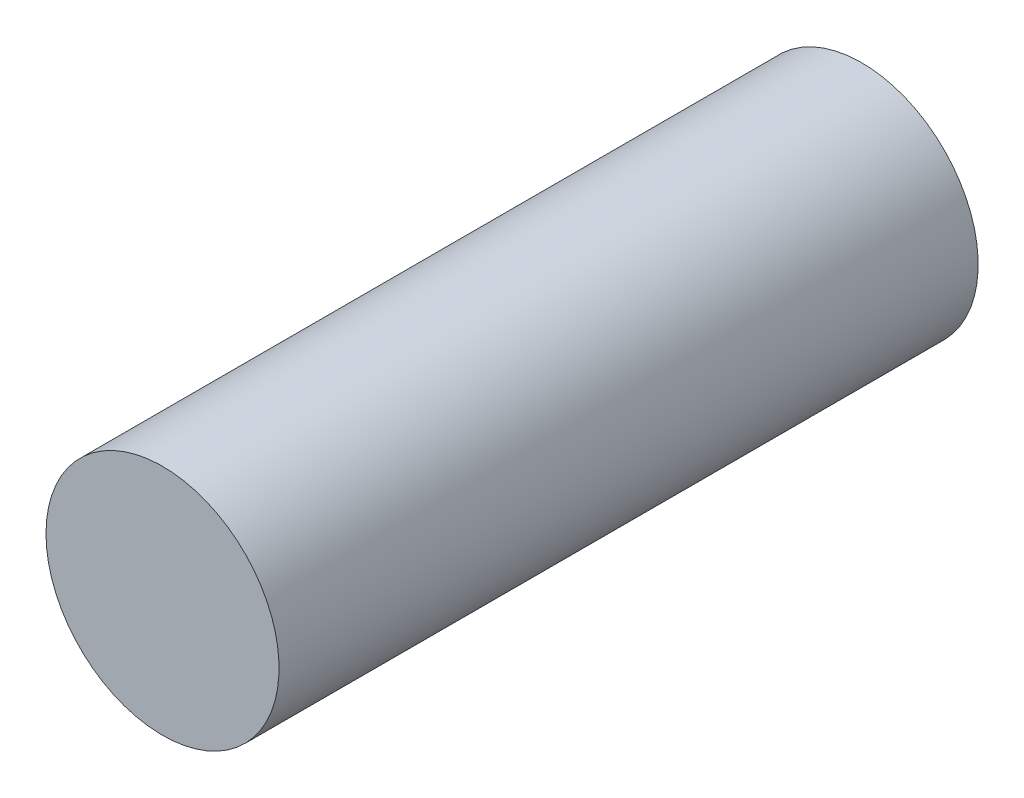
ISO-10303-21;
HEADER;
FILE_DESCRIPTION(('STEP AP214'),'2;1');
FILE_NAME('part.step','',(''),(''),'','','');
FILE_SCHEMA(('AUTOMOTIVE_DESIGN { 1 0 10303 214 1 1 1 1 }'));
ENDSEC;
DATA;
#1=APPLICATION_CONTEXT('core data for automotive mechanical design processes');
#2=APPLICATION_PROTOCOL_DEFINITION('international standard','automotive_design',2000,#1);
#3=PRODUCT_CONTEXT('',#1,'mechanical');
#4=PRODUCT('Part','Part','',(#3));
#5=PRODUCT_RELATED_PRODUCT_CATEGORY('part','',(#4));
#6=PRODUCT_DEFINITION_FORMATION('','',#4);
#7=PRODUCT_DEFINITION_CONTEXT('part definition',#1,'design');
#8=PRODUCT_DEFINITION('design','',#6,#7);
#9=PRODUCT_DEFINITION_SHAPE('','',#8);
#10=(LENGTH_UNIT() NAMED_UNIT(*) SI_UNIT(.MILLI.,.METRE.));
#11=(NAMED_UNIT(*) PLANE_ANGLE_UNIT() SI_UNIT($,.RADIAN.));
#12=(NAMED_UNIT(*) SI_UNIT($,.STERADIAN.) SOLID_ANGLE_UNIT());
#13=UNCERTAINTY_MEASURE_WITH_UNIT(LENGTH_MEASURE(1.E-05),#10,'distance_accuracy_value','');
#14=(GEOMETRIC_REPRESENTATION_CONTEXT(3) GLOBAL_UNCERTAINTY_ASSIGNED_CONTEXT((#13)) GLOBAL_UNIT_ASSIGNED_CONTEXT((#10,
#11,#12)) REPRESENTATION_CONTEXT('',''));
#15=CARTESIAN_POINT('',(0.,0.,0.));
#16=DIRECTION('',(0.,0.,1.));
#17=DIRECTION('',(1.,0.,0.));
#18=AXIS2_PLACEMENT_3D('',#15,#16,#17);
#19=CARTESIAN_POINT('',(0.,0.,50.8));
#20=DIRECTION('',(0.,0.,-1.));
#21=DIRECTION('',(-1.,0.,0.));
#22=AXIS2_PLACEMENT_3D('',#19,#20,#21);
#23=CYLINDRICAL_SURFACE('',#22,12.7);
#24=CARTESIAN_POINT('',(0.,0.,50.8));
#25=DIRECTION('',(0.,0.,1.));
#26=DIRECTION('',(1.,0.,0.));
#27=AXIS2_PLACEMENT_3D('',#24,#25,#26);
#28=CIRCLE('',#27,12.7);
#29=CARTESIAN_POINT('',(-12.7,0.,50.8));
#30=VERTEX_POINT('',#29);
#31=EDGE_CURVE('E10',#30,#30,#28,.T.);
#32=CARTESIAN_POINT('',(0.,0.,-25.4));
#33=DIRECTION('',(0.,0.,1.));
#34=DIRECTION('',(1.,0.,0.));
#35=AXIS2_PLACEMENT_3D('',#32,#33,#34);
#36=CIRCLE('',#35,12.7);
#37=CARTESIAN_POINT('',(-12.7,0.,-25.4));
#38=VERTEX_POINT('',#37);
#39=EDGE_CURVE('E30',#38,#38,#36,.T.);
#40=CARTESIAN_POINT('',(-12.7,0.,50.8));
#41=CARTESIAN_POINT('',(-12.7,0.,50.00625));
#42=CARTESIAN_POINT('',(-12.7,0.,49.2125));
#43=CARTESIAN_POINT('',(-12.7,0.,47.625));
#44=CARTESIAN_POINT('',(-12.7,0.,46.83125));
#45=CARTESIAN_POINT('',(-12.7,0.,45.24375));
#46=CARTESIAN_POINT('',(-12.7,0.,44.45));
#47=CARTESIAN_POINT('',(-12.7,0.,42.8625));
#48=CARTESIAN_POINT('',(-12.7,0.,42.06875));
#49=CARTESIAN_POINT('',(-12.7,0.,40.48125));
#50=CARTESIAN_POINT('',(-12.7,0.,39.6875));
#51=CARTESIAN_POINT('',(-12.7,0.,38.1));
#52=CARTESIAN_POINT('',(-12.7,0.,37.30625));
#53=CARTESIAN_POINT('',(-12.7,0.,35.71875));
#54=CARTESIAN_POINT('',(-12.7,0.,34.925));
#55=CARTESIAN_POINT('',(-12.7,0.,33.3375));
#56=CARTESIAN_POINT('',(-12.7,0.,32.54375));
#57=CARTESIAN_POINT('',(-12.7,0.,30.95625));
#58=CARTESIAN_POINT('',(-12.7,0.,30.1625));
#59=CARTESIAN_POINT('',(-12.7,0.,28.575));
#60=CARTESIAN_POINT('',(-12.7,0.,27.78125));
#61=CARTESIAN_POINT('',(-12.7,0.,26.19375));
#62=CARTESIAN_POINT('',(-12.7,0.,25.4));
#63=CARTESIAN_POINT('',(-12.7,0.,23.8125));
#64=CARTESIAN_POINT('',(-12.7,0.,23.01875));
#65=CARTESIAN_POINT('',(-12.7,0.,21.43125));
#66=CARTESIAN_POINT('',(-12.7,0.,20.6375));
#67=CARTESIAN_POINT('',(-12.7,0.,19.05));
#68=CARTESIAN_POINT('',(-12.7,0.,18.25625));
#69=CARTESIAN_POINT('',(-12.7,0.,16.66875));
#70=CARTESIAN_POINT('',(-12.7,0.,15.875));
#71=CARTESIAN_POINT('',(-12.7,0.,14.2875));
#72=CARTESIAN_POINT('',(-12.7,0.,13.49375));
#73=CARTESIAN_POINT('',(-12.7,0.,11.90625));
#74=CARTESIAN_POINT('',(-12.7,0.,11.1125));
#75=CARTESIAN_POINT('',(-12.7,0.,9.52499999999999));
#76=CARTESIAN_POINT('',(-12.7,0.,8.73124999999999));
#77=CARTESIAN_POINT('',(-12.7,0.,7.14374999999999));
#78=CARTESIAN_POINT('',(-12.7,0.,6.34999999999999));
#79=CARTESIAN_POINT('',(-12.7,0.,4.76249999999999));
#80=CARTESIAN_POINT('',(-12.7,0.,3.96874999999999));
#81=CARTESIAN_POINT('',(-12.7,0.,2.38124999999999));
#82=CARTESIAN_POINT('',(-12.7,0.,1.58749999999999));
#83=CARTESIAN_POINT('',(-12.7,0.,0.));
#84=CARTESIAN_POINT('',(-12.7,0.,-0.793750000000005));
#85=CARTESIAN_POINT('',(-12.7,0.,-2.38125000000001));
#86=CARTESIAN_POINT('',(-12.7,0.,-3.17500000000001));
#87=CARTESIAN_POINT('',(-12.7,0.,-4.76250000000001));
#88=CARTESIAN_POINT('',(-12.7,0.,-5.55625000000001));
#89=CARTESIAN_POINT('',(-12.7,0.,-7.14375000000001));
#90=CARTESIAN_POINT('',(-12.7,0.,-7.93750000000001));
#91=CARTESIAN_POINT('',(-12.7,0.,-9.52500000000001));
#92=CARTESIAN_POINT('',(-12.7,0.,-10.31875));
#93=CARTESIAN_POINT('',(-12.7,0.,-11.90625));
#94=CARTESIAN_POINT('',(-12.7,0.,-12.7));
#95=CARTESIAN_POINT('',(-12.7,0.,-14.2875));
#96=CARTESIAN_POINT('',(-12.7,0.,-15.08125));
#97=CARTESIAN_POINT('',(-12.7,0.,-16.66875));
#98=CARTESIAN_POINT('',(-12.7,0.,-17.4625));
#99=CARTESIAN_POINT('',(-12.7,0.,-19.05));
#100=CARTESIAN_POINT('',(-12.7,0.,-19.84375));
#101=CARTESIAN_POINT('',(-12.7,0.,-21.43125));
#102=CARTESIAN_POINT('',(-12.7,0.,-22.225));
#103=CARTESIAN_POINT('',(-12.7,0.,-23.8125));
#104=CARTESIAN_POINT('',(-12.7,0.,-24.60625));
#105=CARTESIAN_POINT('',(-12.7,0.,-25.4));
#106=B_SPLINE_CURVE_WITH_KNOTS('',3,(#40,#41,#42,#43,#44,#45,#46,#47,#48,#49,#50,#51,#52,#53,
#54,#55,#56,#57,#58,#59,#60,#61,#62,#63,#64,#65,#66,#67,#68,#69,#70,#71,#72,#73,#74,#75,#76,#77,
#78,#79,#80,#81,#82,#83,#84,#85,#86,#87,#88,#89,#90,#91,#92,#93,#94,#95,#96,#97,#98,#99,#100,
#101,#102,#103,#104,#105),.UNSPECIFIED.,.F.,.F.,(4,2,2,2,2,2,2,2,2,2,2,2,2,2,2,2,2,2,2,2,2,2,2,
2,2,2,2,2,2,2,2,2,4),(0.,2.38124999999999,4.7625,7.14375,9.525,11.90625,14.2875,16.66875,19.05,
21.43125,23.8125,26.19375,28.575,30.95625,33.3375,35.71875,38.1,40.48125,42.8625,45.24375,
47.625,50.00625,52.3875,54.76875,57.15,59.53125,61.9125,64.29375,66.675,69.05625,71.4375,
73.81875,76.2),.UNSPECIFIED.);
#107=EDGE_CURVE('BSEAM24',#30,#38,#106,.T.);
#108=ORIENTED_EDGE('',*,*,#31,.F.);
#109=ORIENTED_EDGE('',*,*,#39,.T.);
#110=ORIENTED_EDGE('',*,*,#107,.T.);
#111=ORIENTED_EDGE('',*,*,#107,.F.);
#112=EDGE_LOOP('',(#108,#110,#109,#111));
#113=FACE_BOUND('',#112,.T.);
#114=ADVANCED_FACE('F24',(#113),#23,.T.);
#115=CARTESIAN_POINT('',(0.,0.,50.8));
#116=DIRECTION('',(0.,0.,1.));
#117=DIRECTION('',(1.,0.,0.));
#118=AXIS2_PLACEMENT_3D('',#115,#116,#117);
#119=PLANE('',#118);
#120=ORIENTED_EDGE('',*,*,#31,.T.);
#121=EDGE_LOOP('',(#120));
#122=FACE_BOUND('',#121,.T.);
#123=ADVANCED_FACE('F39',(#122),#119,.T.);
#124=CARTESIAN_POINT('',(0.,0.,-25.4));
#125=DIRECTION('',(0.,0.,1.));
#126=DIRECTION('',(1.,0.,0.));
#127=AXIS2_PLACEMENT_3D('',#124,#125,#126);
#128=PLANE('',#127);
#129=ORIENTED_EDGE('',*,*,#39,.F.);
#130=EDGE_LOOP('',(#129));
#131=FACE_BOUND('',#130,.T.);
#132=ADVANCED_FACE('F37',(#131),#128,.F.);
#133=CLOSED_SHELL('',(#114,#123,#132));
#134=MANIFOLD_SOLID_BREP('B2',#133);
#135=ADVANCED_BREP_SHAPE_REPRESENTATION('',(#18,#134),#14);
#136=SHAPE_DEFINITION_REPRESENTATION(#9,#135);
ENDSEC;
END-ISO-10303-21;
